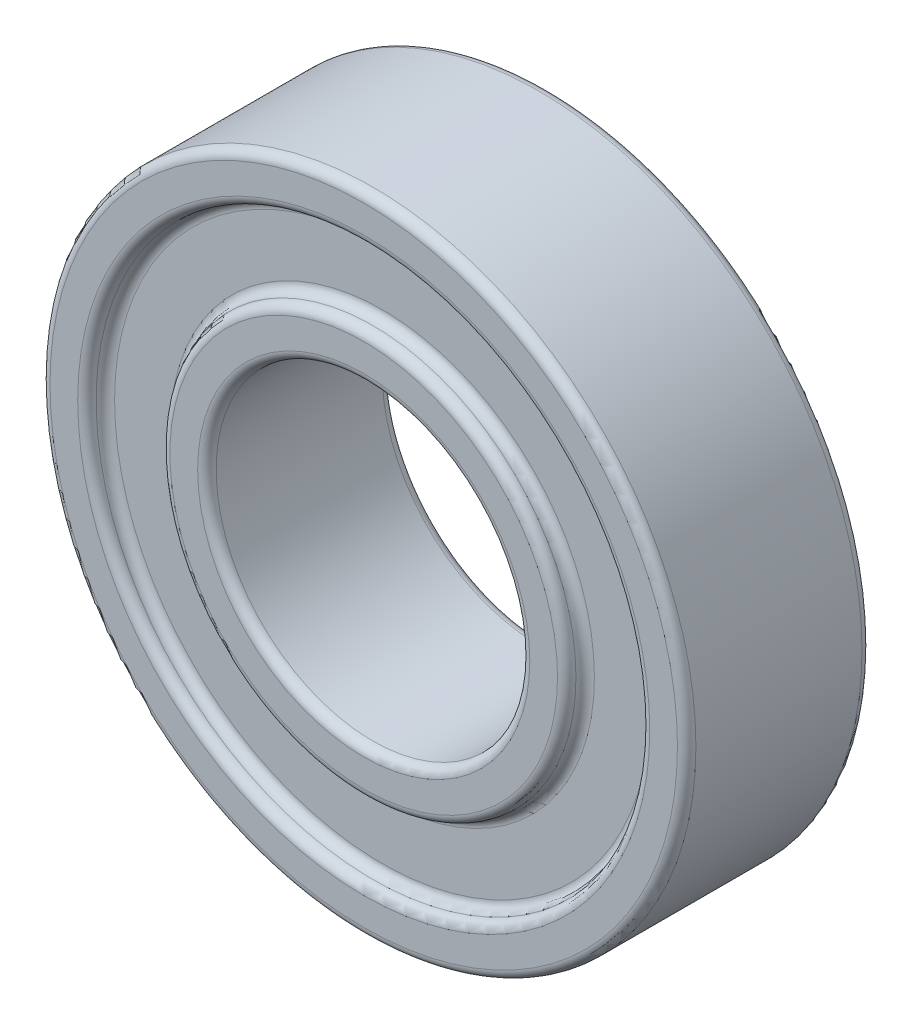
ISO-10303-21;
HEADER;
FILE_DESCRIPTION(('STEP AP214'),'2;1');
FILE_NAME('part.step','',(''),(''),'','','');
FILE_SCHEMA(('AUTOMOTIVE_DESIGN { 1 0 10303 214 1 1 1 1 }'));
ENDSEC;
DATA;
#1=APPLICATION_CONTEXT('core data for automotive mechanical design processes');
#2=APPLICATION_PROTOCOL_DEFINITION('international standard','automotive_design',2000,#1);
#3=PRODUCT_CONTEXT('',#1,'mechanical');
#4=PRODUCT('Part','Part','',(#3));
#5=PRODUCT_RELATED_PRODUCT_CATEGORY('part','',(#4));
#6=PRODUCT_DEFINITION_FORMATION('','',#4);
#7=PRODUCT_DEFINITION_CONTEXT('part definition',#1,'design');
#8=PRODUCT_DEFINITION('design','',#6,#7);
#9=PRODUCT_DEFINITION_SHAPE('','',#8);
#10=(LENGTH_UNIT() NAMED_UNIT(*) SI_UNIT(.MILLI.,.METRE.));
#11=(NAMED_UNIT(*) PLANE_ANGLE_UNIT() SI_UNIT($,.RADIAN.));
#12=(NAMED_UNIT(*) SI_UNIT($,.STERADIAN.) SOLID_ANGLE_UNIT());
#13=UNCERTAINTY_MEASURE_WITH_UNIT(LENGTH_MEASURE(1.E-05),#10,'distance_accuracy_value','');
#14=(GEOMETRIC_REPRESENTATION_CONTEXT(3) GLOBAL_UNCERTAINTY_ASSIGNED_CONTEXT((#13)) GLOBAL_UNIT_ASSIGNED_CONTEXT((#10,
#11,#12)) REPRESENTATION_CONTEXT('',''));
#15=CARTESIAN_POINT('',(0.,0.,0.));
#16=DIRECTION('',(0.,0.,1.));
#17=DIRECTION('',(1.,0.,0.));
#18=AXIS2_PLACEMENT_3D('',#15,#16,#17);
#19=CARTESIAN_POINT('',(0.,0.,0.));
#20=DIRECTION('',(0.,0.,1.));
#21=DIRECTION('',(1.,0.,0.));
#22=AXIS2_PLACEMENT_3D('',#19,#20,#21);
#23=PLANE('',#22);
#24=CARTESIAN_POINT('',(0.,0.,0.));
#25=DIRECTION('',(0.,0.,1.));
#26=DIRECTION('',(1.,0.,0.));
#27=AXIS2_PLACEMENT_3D('',#24,#25,#26);
#28=CIRCLE('',#27,10.5);
#29=CARTESIAN_POINT('',(10.5,0.,0.));
#30=VERTEX_POINT('',#29);
#31=EDGE_CURVE('E50',#30,#30,#28,.F.);
#32=ORIENTED_EDGE('',*,*,#31,.T.);
#33=EDGE_LOOP('',(#32));
#34=FACE_BOUND('',#33,.T.);
#35=CARTESIAN_POINT('',(0.,0.,0.));
#36=DIRECTION('',(0.,0.,1.));
#37=DIRECTION('',(1.,0.,0.));
#38=AXIS2_PLACEMENT_3D('',#35,#36,#37);
#39=CIRCLE('',#38,9.);
#40=CARTESIAN_POINT('',(9.,0.,0.));
#41=VERTEX_POINT('',#40);
#42=EDGE_CURVE('E53',#41,#41,#39,.T.);
#43=ORIENTED_EDGE('',*,*,#42,.T.);
#44=EDGE_LOOP('',(#43));
#45=FACE_BOUND('',#44,.T.);
#46=ADVANCED_FACE('F30',(#34,#45),#23,.F.);
#47=CARTESIAN_POINT('',(0.,0.,10.));
#48=DIRECTION('',(0.,0.,1.));
#49=DIRECTION('',(1.,0.,0.));
#50=AXIS2_PLACEMENT_3D('',#47,#48,#49);
#51=PLANE('',#50);
#52=CARTESIAN_POINT('',(0.,0.,10.));
#53=DIRECTION('',(0.,0.,1.));
#54=DIRECTION('',(1.,0.,0.));
#55=AXIS2_PLACEMENT_3D('',#52,#53,#54);
#56=CIRCLE('',#55,10.5);
#57=CARTESIAN_POINT('',(10.5,0.,10.));
#58=VERTEX_POINT('',#57);
#59=EDGE_CURVE('E80',#58,#58,#56,.T.);
#60=ORIENTED_EDGE('',*,*,#59,.T.);
#61=EDGE_LOOP('',(#60));
#62=FACE_BOUND('',#61,.T.);
#63=CARTESIAN_POINT('',(0.,0.,10.));
#64=DIRECTION('',(0.,0.,1.));
#65=DIRECTION('',(1.,0.,0.));
#66=AXIS2_PLACEMENT_3D('',#63,#64,#65);
#67=CIRCLE('',#66,9.);
#68=CARTESIAN_POINT('',(9.,0.,10.));
#69=VERTEX_POINT('',#68);
#70=EDGE_CURVE('E83',#69,#69,#67,.F.);
#71=ORIENTED_EDGE('',*,*,#70,.T.);
#72=EDGE_LOOP('',(#71));
#73=FACE_BOUND('',#72,.T.);
#74=ADVANCED_FACE('F118',(#62,#73),#51,.T.);
#75=CARTESIAN_POINT('',(0.,0.,10.));
#76=DIRECTION('',(0.,0.,1.));
#77=DIRECTION('',(1.,0.,0.));
#78=AXIS2_PLACEMENT_3D('',#75,#76,#77);
#79=CIRCLE('',#78,15.5);
#80=CARTESIAN_POINT('',(15.5,0.,10.));
#81=VERTEX_POINT('',#80);
#82=EDGE_CURVE('E68',#81,#81,#79,.F.);
#83=ORIENTED_EDGE('',*,*,#82,.T.);
#84=EDGE_LOOP('',(#83));
#85=FACE_BOUND('',#84,.T.);
#86=CARTESIAN_POINT('',(0.,0.,10.));
#87=DIRECTION('',(0.,0.,1.));
#88=DIRECTION('',(1.,0.,0.));
#89=AXIS2_PLACEMENT_3D('',#86,#87,#88);
#90=CIRCLE('',#89,17.);
#91=CARTESIAN_POINT('',(17.,0.,10.));
#92=VERTEX_POINT('',#91);
#93=EDGE_CURVE('E71',#92,#92,#90,.T.);
#94=ORIENTED_EDGE('',*,*,#93,.T.);
#95=EDGE_LOOP('',(#94));
#96=FACE_BOUND('',#95,.T.);
#97=ADVANCED_FACE('F125',(#85,#96),#51,.T.);
#98=CARTESIAN_POINT('',(0.,0.,0.));
#99=DIRECTION('',(0.,0.,1.));
#100=DIRECTION('',(1.,0.,0.));
#101=AXIS2_PLACEMENT_3D('',#98,#99,#100);
#102=CIRCLE('',#101,15.5);
#103=CARTESIAN_POINT('',(15.5,0.,0.));
#104=VERTEX_POINT('',#103);
#105=EDGE_CURVE('E62',#104,#104,#102,.T.);
#106=ORIENTED_EDGE('',*,*,#105,.T.);
#107=EDGE_LOOP('',(#106));
#108=FACE_BOUND('',#107,.T.);
#109=CARTESIAN_POINT('',(0.,0.,0.));
#110=DIRECTION('',(0.,0.,1.));
#111=DIRECTION('',(1.,0.,0.));
#112=AXIS2_PLACEMENT_3D('',#109,#110,#111);
#113=CIRCLE('',#112,17.);
#114=CARTESIAN_POINT('',(17.,0.,0.));
#115=VERTEX_POINT('',#114);
#116=EDGE_CURVE('E65',#115,#115,#113,.F.);
#117=ORIENTED_EDGE('',*,*,#116,.T.);
#118=EDGE_LOOP('',(#117));
#119=FACE_BOUND('',#118,.T.);
#120=ADVANCED_FACE('F121',(#108,#119),#23,.F.);
#121=CARTESIAN_POINT('',(0.,0.,10.));
#122=DIRECTION('',(0.,0.,-1.));
#123=DIRECTION('',(-1.,0.,0.));
#124=AXIS2_PLACEMENT_3D('',#121,#122,#123);
#125=CYLINDRICAL_SURFACE('',#124,17.5);
#126=CARTESIAN_POINT('',(0.,0.,0.5));
#127=DIRECTION('',(0.,0.,1.));
#128=DIRECTION('',(1.,0.,0.));
#129=AXIS2_PLACEMENT_3D('',#126,#127,#128);
#130=CIRCLE('',#129,17.5);
#131=CARTESIAN_POINT('',(17.5,0.,0.5));
#132=VERTEX_POINT('',#131);
#133=EDGE_CURVE('E10',#132,#132,#130,.T.);
#134=ORIENTED_EDGE('',*,*,#133,.T.);
#135=EDGE_LOOP('',(#134));
#136=FACE_BOUND('',#135,.T.);
#137=CARTESIAN_POINT('',(0.,0.,9.5));
#138=DIRECTION('',(0.,0.,1.));
#139=DIRECTION('',(1.,0.,0.));
#140=AXIS2_PLACEMENT_3D('',#137,#138,#139);
#141=CIRCLE('',#140,17.5);
#142=CARTESIAN_POINT('',(17.5,0.,9.5));
#143=VERTEX_POINT('',#142);
#144=EDGE_CURVE('E37',#143,#143,#141,.F.);
#145=ORIENTED_EDGE('',*,*,#144,.T.);
#146=EDGE_LOOP('',(#145));
#147=FACE_BOUND('',#146,.T.);
#148=ADVANCED_FACE('F32',(#136,#147),#125,.T.);
#149=CARTESIAN_POINT('',(0.,0.,10.));
#150=DIRECTION('',(0.,0.,-1.));
#151=DIRECTION('',(-1.,0.,0.));
#152=AXIS2_PLACEMENT_3D('',#149,#150,#151);
#153=CYLINDRICAL_SURFACE('',#152,8.5);
#154=CARTESIAN_POINT('',(0.,0.,0.5));
#155=DIRECTION('',(0.,0.,1.));
#156=DIRECTION('',(1.,0.,0.));
#157=AXIS2_PLACEMENT_3D('',#154,#155,#156);
#158=CIRCLE('',#157,8.5);
#159=CARTESIAN_POINT('',(8.5,0.,0.5));
#160=VERTEX_POINT('',#159);
#161=EDGE_CURVE('E41',#160,#160,#158,.F.);
#162=ORIENTED_EDGE('',*,*,#161,.T.);
#163=EDGE_LOOP('',(#162));
#164=FACE_BOUND('',#163,.T.);
#165=CARTESIAN_POINT('',(0.,0.,9.5));
#166=DIRECTION('',(0.,0.,1.));
#167=DIRECTION('',(1.,0.,0.));
#168=AXIS2_PLACEMENT_3D('',#165,#166,#167);
#169=CIRCLE('',#168,8.5);
#170=CARTESIAN_POINT('',(8.5,0.,9.5));
#171=VERTEX_POINT('',#170);
#172=EDGE_CURVE('E45',#171,#171,#169,.T.);
#173=ORIENTED_EDGE('',*,*,#172,.T.);
#174=EDGE_LOOP('',(#173));
#175=FACE_BOUND('',#174,.T.);
#176=ADVANCED_FACE('F135',(#164,#175),#153,.F.);
#177=CARTESIAN_POINT('',(0.,0.,9.));
#178=DIRECTION('',(0.,0.,1.));
#179=DIRECTION('',(1.,0.,0.));
#180=AXIS2_PLACEMENT_3D('',#177,#178,#179);
#181=PLANE('',#180);
#182=CARTESIAN_POINT('',(0.,0.,9.));
#183=DIRECTION('',(0.,0.,1.));
#184=DIRECTION('',(1.,0.,0.));
#185=AXIS2_PLACEMENT_3D('',#182,#183,#184);
#186=CIRCLE('',#185,11.5);
#187=CARTESIAN_POINT('',(11.5,0.,9.));
#188=VERTEX_POINT('',#187);
#189=EDGE_CURVE('E74',#188,#188,#186,.F.);
#190=ORIENTED_EDGE('',*,*,#189,.T.);
#191=EDGE_LOOP('',(#190));
#192=FACE_BOUND('',#191,.T.);
#193=CARTESIAN_POINT('',(0.,0.,9.));
#194=DIRECTION('',(0.,0.,1.));
#195=DIRECTION('',(1.,0.,0.));
#196=AXIS2_PLACEMENT_3D('',#193,#194,#195);
#197=CIRCLE('',#196,14.5);
#198=CARTESIAN_POINT('',(14.5,0.,9.));
#199=VERTEX_POINT('',#198);
#200=EDGE_CURVE('E77',#199,#199,#197,.T.);
#201=ORIENTED_EDGE('',*,*,#200,.T.);
#202=EDGE_LOOP('',(#201));
#203=FACE_BOUND('',#202,.T.);
#204=ADVANCED_FACE('F166',(#192,#203),#181,.T.);
#205=CARTESIAN_POINT('',(0.,0.,1.));
#206=DIRECTION('',(0.,0.,-1.));
#207=DIRECTION('',(-1.,0.,0.));
#208=AXIS2_PLACEMENT_3D('',#205,#206,#207);
#209=PLANE('',#208);
#210=CARTESIAN_POINT('',(0.,0.,1.));
#211=DIRECTION('',(0.,0.,-1.));
#212=DIRECTION('',(-1.,0.,0.));
#213=AXIS2_PLACEMENT_3D('',#210,#211,#212);
#214=CIRCLE('',#213,14.5);
#215=CARTESIAN_POINT('',(-14.5,0.,1.));
#216=VERTEX_POINT('',#215);
#217=EDGE_CURVE('E56',#216,#216,#214,.T.);
#218=ORIENTED_EDGE('',*,*,#217,.T.);
#219=EDGE_LOOP('',(#218));
#220=FACE_BOUND('',#219,.T.);
#221=CARTESIAN_POINT('',(0.,0.,1.));
#222=DIRECTION('',(0.,0.,-1.));
#223=DIRECTION('',(-1.,0.,0.));
#224=AXIS2_PLACEMENT_3D('',#221,#222,#223);
#225=CIRCLE('',#224,11.5);
#226=CARTESIAN_POINT('',(-11.5,0.,1.));
#227=VERTEX_POINT('',#226);
#228=EDGE_CURVE('E59',#227,#227,#225,.F.);
#229=ORIENTED_EDGE('',*,*,#228,.T.);
#230=EDGE_LOOP('',(#229));
#231=FACE_BOUND('',#230,.T.);
#232=ADVANCED_FACE('F172',(#220,#231),#209,.T.);
#233=CARTESIAN_POINT('',(0.,0.,9.5));
#234=DIRECTION('',(0.,0.,1.));
#235=DIRECTION('',(1.,0.,0.));
#236=AXIS2_PLACEMENT_3D('',#233,#234,#235);
#237=TOROIDAL_SURFACE('',#236,11.5,0.5);
#238=ORIENTED_EDGE('',*,*,#189,.F.);
#239=EDGE_LOOP('',(#238));
#240=FACE_BOUND('',#239,.T.);
#241=CARTESIAN_POINT('',(0.,0.,9.5));
#242=DIRECTION('',(0.,0.,1.));
#243=DIRECTION('',(1.,0.,0.));
#244=AXIS2_PLACEMENT_3D('',#241,#242,#243);
#245=CIRCLE('',#244,11.);
#246=CARTESIAN_POINT('',(11.,0.,9.5));
#247=VERTEX_POINT('',#246);
#248=EDGE_CURVE('E86',#247,#247,#245,.T.);
#249=ORIENTED_EDGE('',*,*,#248,.F.);
#250=EDGE_LOOP('',(#249));
#251=FACE_BOUND('',#250,.T.);
#252=ADVANCED_FACE('F178',(#240,#251),#237,.F.);
#253=CARTESIAN_POINT('',(0.,0.,9.5));
#254=DIRECTION('',(0.,0.,1.));
#255=DIRECTION('',(1.,0.,0.));
#256=AXIS2_PLACEMENT_3D('',#253,#254,#255);
#257=TOROIDAL_SURFACE('',#256,10.5,0.5);
#258=ORIENTED_EDGE('',*,*,#248,.T.);
#259=EDGE_LOOP('',(#258));
#260=FACE_BOUND('',#259,.T.);
#261=ORIENTED_EDGE('',*,*,#59,.F.);
#262=EDGE_LOOP('',(#261));
#263=FACE_BOUND('',#262,.T.);
#264=ADVANCED_FACE('F182',(#260,#263),#257,.T.);
#265=CARTESIAN_POINT('',(0.,0.,9.5));
#266=DIRECTION('',(0.,0.,1.));
#267=DIRECTION('',(1.,0.,0.));
#268=AXIS2_PLACEMENT_3D('',#265,#266,#267);
#269=TOROIDAL_SURFACE('',#268,14.5,0.5);
#270=ORIENTED_EDGE('',*,*,#200,.F.);
#271=EDGE_LOOP('',(#270));
#272=FACE_BOUND('',#271,.T.);
#273=CARTESIAN_POINT('',(0.,0.,9.5));
#274=DIRECTION('',(0.,0.,1.));
#275=DIRECTION('',(1.,0.,0.));
#276=AXIS2_PLACEMENT_3D('',#273,#274,#275);
#277=CIRCLE('',#276,15.);
#278=CARTESIAN_POINT('',(15.,0.,9.5));
#279=VERTEX_POINT('',#278);
#280=EDGE_CURVE('E89',#279,#279,#277,.F.);
#281=ORIENTED_EDGE('',*,*,#280,.F.);
#282=EDGE_LOOP('',(#281));
#283=FACE_BOUND('',#282,.T.);
#284=ADVANCED_FACE('F186',(#272,#283),#269,.F.);
#285=CARTESIAN_POINT('',(0.,0.,9.5));
#286=DIRECTION('',(0.,0.,1.));
#287=DIRECTION('',(1.,0.,0.));
#288=AXIS2_PLACEMENT_3D('',#285,#286,#287);
#289=TOROIDAL_SURFACE('',#288,15.5,0.5);
#290=ORIENTED_EDGE('',*,*,#82,.F.);
#291=EDGE_LOOP('',(#290));
#292=FACE_BOUND('',#291,.T.);
#293=ORIENTED_EDGE('',*,*,#280,.T.);
#294=EDGE_LOOP('',(#293));
#295=FACE_BOUND('',#294,.T.);
#296=ADVANCED_FACE('F190',(#292,#295),#289,.T.);
#297=CARTESIAN_POINT('',(0.,0.,0.5));
#298=DIRECTION('',(0.,0.,-1.));
#299=DIRECTION('',(-1.,0.,0.));
#300=AXIS2_PLACEMENT_3D('',#297,#298,#299);
#301=TOROIDAL_SURFACE('',#300,14.5,0.5);
#302=ORIENTED_EDGE('',*,*,#217,.F.);
#303=EDGE_LOOP('',(#302));
#304=FACE_BOUND('',#303,.T.);
#305=CARTESIAN_POINT('',(0.,0.,0.5));
#306=DIRECTION('',(0.,0.,-1.));
#307=DIRECTION('',(-1.,0.,0.));
#308=AXIS2_PLACEMENT_3D('',#305,#306,#307);
#309=CIRCLE('',#308,15.);
#310=CARTESIAN_POINT('',(-15.,0.,0.5));
#311=VERTEX_POINT('',#310);
#312=EDGE_CURVE('E92',#311,#311,#309,.F.);
#313=ORIENTED_EDGE('',*,*,#312,.F.);
#314=EDGE_LOOP('',(#313));
#315=FACE_BOUND('',#314,.T.);
#316=ADVANCED_FACE('F113',(#304,#315),#301,.F.);
#317=CARTESIAN_POINT('',(0.,0.,0.5));
#318=DIRECTION('',(0.,0.,1.));
#319=DIRECTION('',(1.,0.,0.));
#320=AXIS2_PLACEMENT_3D('',#317,#318,#319);
#321=TOROIDAL_SURFACE('',#320,15.5,0.5);
#322=ORIENTED_EDGE('',*,*,#105,.F.);
#323=EDGE_LOOP('',(#322));
#324=FACE_BOUND('',#323,.T.);
#325=ORIENTED_EDGE('',*,*,#312,.T.);
#326=EDGE_LOOP('',(#325));
#327=FACE_BOUND('',#326,.T.);
#328=ADVANCED_FACE('F104',(#324,#327),#321,.T.);
#329=CARTESIAN_POINT('',(0.,0.,0.5));
#330=DIRECTION('',(0.,0.,-1.));
#331=DIRECTION('',(-1.,0.,0.));
#332=AXIS2_PLACEMENT_3D('',#329,#330,#331);
#333=TOROIDAL_SURFACE('',#332,11.5,0.5);
#334=ORIENTED_EDGE('',*,*,#228,.F.);
#335=EDGE_LOOP('',(#334));
#336=FACE_BOUND('',#335,.T.);
#337=CARTESIAN_POINT('',(0.,0.,0.5));
#338=DIRECTION('',(0.,0.,-1.));
#339=DIRECTION('',(-1.,0.,0.));
#340=AXIS2_PLACEMENT_3D('',#337,#338,#339);
#341=CIRCLE('',#340,11.);
#342=CARTESIAN_POINT('',(-11.,0.,0.5));
#343=VERTEX_POINT('',#342);
#344=EDGE_CURVE('E95',#343,#343,#341,.T.);
#345=ORIENTED_EDGE('',*,*,#344,.F.);
#346=EDGE_LOOP('',(#345));
#347=FACE_BOUND('',#346,.T.);
#348=ADVANCED_FACE('F102',(#336,#347),#333,.F.);
#349=CARTESIAN_POINT('',(0.,0.,0.5));
#350=DIRECTION('',(0.,0.,1.));
#351=DIRECTION('',(1.,0.,0.));
#352=AXIS2_PLACEMENT_3D('',#349,#350,#351);
#353=TOROIDAL_SURFACE('',#352,10.5,0.5);
#354=ORIENTED_EDGE('',*,*,#344,.T.);
#355=EDGE_LOOP('',(#354));
#356=FACE_BOUND('',#355,.T.);
#357=ORIENTED_EDGE('',*,*,#31,.F.);
#358=EDGE_LOOP('',(#357));
#359=FACE_BOUND('',#358,.T.);
#360=ADVANCED_FACE('F99',(#356,#359),#353,.T.);
#361=CARTESIAN_POINT('',(0.,0.,0.5));
#362=DIRECTION('',(0.,0.,1.));
#363=DIRECTION('',(1.,0.,0.));
#364=AXIS2_PLACEMENT_3D('',#361,#362,#363);
#365=TOROIDAL_SURFACE('',#364,9.,0.5);
#366=ORIENTED_EDGE('',*,*,#161,.F.);
#367=EDGE_LOOP('',(#366));
#368=FACE_BOUND('',#367,.T.);
#369=ORIENTED_EDGE('',*,*,#42,.F.);
#370=EDGE_LOOP('',(#369));
#371=FACE_BOUND('',#370,.T.);
#372=ADVANCED_FACE('F111',(#368,#371),#365,.T.);
#373=CARTESIAN_POINT('',(0.,0.,9.5));
#374=DIRECTION('',(0.,0.,1.));
#375=DIRECTION('',(1.,0.,0.));
#376=AXIS2_PLACEMENT_3D('',#373,#374,#375);
#377=TOROIDAL_SURFACE('',#376,9.,0.5);
#378=ORIENTED_EDGE('',*,*,#70,.F.);
#379=EDGE_LOOP('',(#378));
#380=FACE_BOUND('',#379,.T.);
#381=ORIENTED_EDGE('',*,*,#172,.F.);
#382=EDGE_LOOP('',(#381));
#383=FACE_BOUND('',#382,.T.);
#384=ADVANCED_FACE('F145',(#380,#383),#377,.T.);
#385=CARTESIAN_POINT('',(0.,0.,0.5));
#386=DIRECTION('',(0.,0.,1.));
#387=DIRECTION('',(1.,0.,0.));
#388=AXIS2_PLACEMENT_3D('',#385,#386,#387);
#389=TOROIDAL_SURFACE('',#388,17.,0.5);
#390=ORIENTED_EDGE('',*,*,#116,.F.);
#391=EDGE_LOOP('',(#390));
#392=FACE_BOUND('',#391,.T.);
#393=ORIENTED_EDGE('',*,*,#133,.F.);
#394=EDGE_LOOP('',(#393));
#395=FACE_BOUND('',#394,.T.);
#396=ADVANCED_FACE('F141',(#392,#395),#389,.T.);
#397=CARTESIAN_POINT('',(0.,0.,9.5));
#398=DIRECTION('',(0.,0.,1.));
#399=DIRECTION('',(1.,0.,0.));
#400=AXIS2_PLACEMENT_3D('',#397,#398,#399);
#401=TOROIDAL_SURFACE('',#400,17.,0.5);
#402=ORIENTED_EDGE('',*,*,#144,.F.);
#403=EDGE_LOOP('',(#402));
#404=FACE_BOUND('',#403,.T.);
#405=ORIENTED_EDGE('',*,*,#93,.F.);
#406=EDGE_LOOP('',(#405));
#407=FACE_BOUND('',#406,.T.);
#408=ADVANCED_FACE('F144',(#404,#407),#401,.T.);
#409=CLOSED_SHELL('',(#46,#74,#97,#120,#148,#176,#204,#232,#252,#264,#284,#296,#316,#328,#348,
#360,#372,#384,#396,#408));
#410=MANIFOLD_SOLID_BREP('B2',#409);
#411=ADVANCED_BREP_SHAPE_REPRESENTATION('',(#18,#410),#14);
#412=SHAPE_DEFINITION_REPRESENTATION(#9,#411);
ENDSEC;
END-ISO-10303-21;
